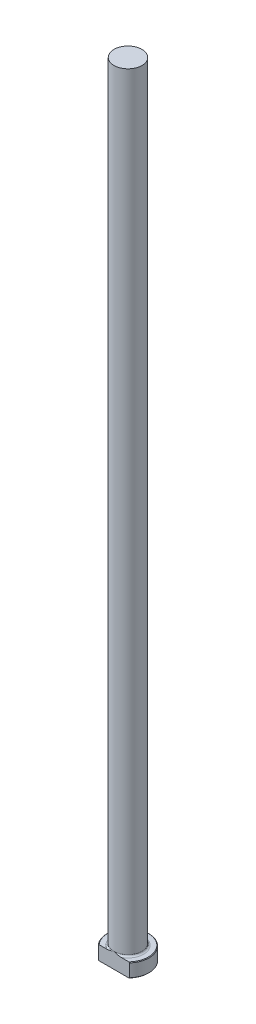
ISO-10303-21;
HEADER;
FILE_DESCRIPTION(('STEP AP214'),'2;1');
FILE_NAME('part.step','',(''),(''),'','','');
FILE_SCHEMA(('AUTOMOTIVE_DESIGN { 1 0 10303 214 1 1 1 1 }'));
ENDSEC;
DATA;
#1=APPLICATION_CONTEXT('core data for automotive mechanical design processes');
#2=APPLICATION_PROTOCOL_DEFINITION('international standard','automotive_design',2000,#1);
#3=PRODUCT_CONTEXT('',#1,'mechanical');
#4=PRODUCT('Part','Part','',(#3));
#5=PRODUCT_RELATED_PRODUCT_CATEGORY('part','',(#4));
#6=PRODUCT_DEFINITION_FORMATION('','',#4);
#7=PRODUCT_DEFINITION_CONTEXT('part definition',#1,'design');
#8=PRODUCT_DEFINITION('design','',#6,#7);
#9=PRODUCT_DEFINITION_SHAPE('','',#8);
#10=(LENGTH_UNIT() NAMED_UNIT(*) SI_UNIT(.MILLI.,.METRE.));
#11=(NAMED_UNIT(*) PLANE_ANGLE_UNIT() SI_UNIT($,.RADIAN.));
#12=(NAMED_UNIT(*) SI_UNIT($,.STERADIAN.) SOLID_ANGLE_UNIT());
#13=UNCERTAINTY_MEASURE_WITH_UNIT(LENGTH_MEASURE(1.E-05),#10,'distance_accuracy_value','');
#14=(GEOMETRIC_REPRESENTATION_CONTEXT(3) GLOBAL_UNCERTAINTY_ASSIGNED_CONTEXT((#13)) GLOBAL_UNIT_ASSIGNED_CONTEXT((#10,
#11,#12)) REPRESENTATION_CONTEXT('',''));
#15=CARTESIAN_POINT('',(0.,0.,0.));
#16=DIRECTION('',(0.,0.,1.));
#17=DIRECTION('',(1.,0.,0.));
#18=AXIS2_PLACEMENT_3D('',#15,#16,#17);
#19=CARTESIAN_POINT('',(0.,0.,0.));
#20=DIRECTION('',(0.,-1.,0.));
#21=DIRECTION('',(0.,0.,-1.));
#22=AXIS2_PLACEMENT_3D('',#19,#20,#21);
#23=PLANE('',#22);
#24=DIRECTION('',(1.,0.,0.));
#25=VECTOR('',#24,1.);
#26=CARTESIAN_POINT('',(-7.09951582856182,0.,6.34999999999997));
#27=LINE('',#26,#25);
#28=CARTESIAN_POINT('',(-6.75491976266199,0.,6.34999999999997));
#29=VERTEX_POINT('',#28);
#30=CARTESIAN_POINT('',(6.75491976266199,0.,6.34999999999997));
#31=VERTEX_POINT('',#30);
#32=EDGE_CURVE('E92',#29,#31,#27,.T.);
#33=ORIENTED_EDGE('',*,*,#32,.F.);
#34=CARTESIAN_POINT('',(0.,0.,0.));
#35=DIRECTION('',(0.,-1.,0.));
#36=DIRECTION('',(0.,0.,-1.));
#37=AXIS2_PLACEMENT_3D('',#34,#35,#36);
#38=CIRCLE('',#37,9.27100000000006);
#39=EDGE_CURVE('E105',#29,#31,#38,.T.);
#40=ORIENTED_EDGE('',*,*,#39,.T.);
#41=EDGE_LOOP('',(#33,#40));
#42=FACE_BOUND('',#41,.T.);
#43=ADVANCED_FACE('F37',(#42),#23,.T.);
#44=CARTESIAN_POINT('',(0.,259.958771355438,0.));
#45=DIRECTION('',(0.,1.,0.));
#46=DIRECTION('',(0.,0.,1.));
#47=AXIS2_PLACEMENT_3D('',#44,#45,#46);
#48=CYLINDRICAL_SURFACE('',#47,9.52499999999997);
#49=DIRECTION('',(0.,-1.,0.));
#50=VECTOR('',#49,1.);
#51=CARTESIAN_POINT('',(-7.09951582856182,355.6,6.34999999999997));
#52=LINE('',#51,#50);
#53=CARTESIAN_POINT('',(-7.09951582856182,6.09600000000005,6.34999999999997));
#54=VERTEX_POINT('',#53);
#55=CARTESIAN_POINT('',(-7.09951582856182,0.253999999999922,6.34999999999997));
#56=VERTEX_POINT('',#55);
#57=EDGE_CURVE('E95',#54,#56,#52,.T.);
#58=ORIENTED_EDGE('',*,*,#57,.F.);
#59=CARTESIAN_POINT('',(0.,6.09600000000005,0.));
#60=DIRECTION('',(0.,1.,0.));
#61=DIRECTION('',(0.,0.,1.));
#62=AXIS2_PLACEMENT_3D('',#59,#60,#61);
#63=CIRCLE('',#62,9.52499999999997);
#64=CARTESIAN_POINT('',(7.09951582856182,6.09600000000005,6.34999999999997));
#65=VERTEX_POINT('',#64);
#66=EDGE_CURVE('E109',#54,#65,#63,.F.);
#67=ORIENTED_EDGE('',*,*,#66,.T.);
#68=DIRECTION('',(0.,-1.,0.));
#69=VECTOR('',#68,1.);
#70=CARTESIAN_POINT('',(7.09951582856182,355.6,6.34999999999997));
#71=LINE('',#70,#69);
#72=CARTESIAN_POINT('',(7.09951582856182,0.253999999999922,6.34999999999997));
#73=VERTEX_POINT('',#72);
#74=EDGE_CURVE('E187',#65,#73,#71,.T.);
#75=ORIENTED_EDGE('',*,*,#74,.T.);
#76=CARTESIAN_POINT('',(0.,0.253999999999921,0.));
#77=DIRECTION('',(0.,-1.,0.));
#78=DIRECTION('',(0.,0.,-1.));
#79=AXIS2_PLACEMENT_3D('',#76,#77,#78);
#80=CIRCLE('',#79,9.52499999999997);
#81=EDGE_CURVE('E115',#73,#56,#80,.F.);
#82=ORIENTED_EDGE('',*,*,#81,.T.);
#83=EDGE_LOOP('',(#58,#67,#75,#82));
#84=FACE_BOUND('',#83,.T.);
#85=ADVANCED_FACE('F160',(#84),#48,.T.);
#86=CARTESIAN_POINT('',(-9.52499999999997,6.35,0.));
#87=DIRECTION('',(0.,1.,0.));
#88=DIRECTION('',(0.,0.,1.));
#89=AXIS2_PLACEMENT_3D('',#86,#87,#88);
#90=PLANE('',#89);
#91=DIRECTION('',(-1.,0.,0.));
#92=VECTOR('',#91,1.);
#93=CARTESIAN_POINT('',(-9.52499999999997,6.35,6.34999999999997));
#94=LINE('',#93,#92);
#95=CARTESIAN_POINT('',(6.75491976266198,6.35,6.34999999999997));
#96=VERTEX_POINT('',#95);
#97=CARTESIAN_POINT('',(3.20281813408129,6.35,6.34999999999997));
#98=VERTEX_POINT('',#97);
#99=EDGE_CURVE('E58',#96,#98,#94,.T.);
#100=ORIENTED_EDGE('',*,*,#99,.F.);
#101=CARTESIAN_POINT('',(0.,6.35,0.));
#102=DIRECTION('',(0.,1.,0.));
#103=DIRECTION('',(0.,0.,1.));
#104=AXIS2_PLACEMENT_3D('',#101,#102,#103);
#105=CIRCLE('',#104,9.27100000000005);
#106=CARTESIAN_POINT('',(-6.75491976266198,6.35,6.34999999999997));
#107=VERTEX_POINT('',#106);
#108=EDGE_CURVE('E182',#96,#107,#105,.T.);
#109=ORIENTED_EDGE('',*,*,#108,.T.);
#110=CARTESIAN_POINT('',(-3.20281813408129,6.35000000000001,6.34999999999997));
#111=VERTEX_POINT('',#110);
#112=EDGE_CURVE('E140',#111,#107,#94,.T.);
#113=ORIENTED_EDGE('',*,*,#112,.F.);
#114=CARTESIAN_POINT('',(0.,6.35,0.));
#115=DIRECTION('',(0.,1.,0.));
#116=DIRECTION('',(0.,0.,1.));
#117=AXIS2_PLACEMENT_3D('',#114,#115,#116);
#118=CIRCLE('',#117,7.11199999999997);
#119=EDGE_CURVE('E112',#111,#98,#118,.F.);
#120=ORIENTED_EDGE('',*,*,#119,.T.);
#121=EDGE_LOOP('',(#100,#109,#113,#120));
#122=FACE_BOUND('',#121,.T.);
#123=ADVANCED_FACE('F164',(#122),#90,.T.);
#124=CARTESIAN_POINT('',(0.,259.958771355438,0.));
#125=DIRECTION('',(0.,1.,0.));
#126=DIRECTION('',(0.,0.,1.));
#127=AXIS2_PLACEMENT_3D('',#124,#125,#126);
#128=CYLINDRICAL_SURFACE('',#127,6.34999999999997);
#129=CARTESIAN_POINT('',(0.,7.11200000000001,0.));
#130=DIRECTION('',(0.,1.,0.));
#131=DIRECTION('',(0.,0.,1.));
#132=AXIS2_PLACEMENT_3D('',#129,#130,#131);
#133=CIRCLE('',#132,6.34999999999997);
#134=CARTESIAN_POINT('',(0.,7.11200000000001,6.34999999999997));
#135=VERTEX_POINT('',#134);
#136=EDGE_CURVE('E108',#135,#135,#133,.T.);
#137=ORIENTED_EDGE('',*,*,#136,.T.);
#138=EDGE_LOOP('',(#137));
#139=FACE_BOUND('',#138,.T.);
#140=CARTESIAN_POINT('',(0.,355.6,0.));
#141=DIRECTION('',(0.,1.,0.));
#142=DIRECTION('',(0.,0.,1.));
#143=AXIS2_PLACEMENT_3D('',#140,#141,#142);
#144=CIRCLE('',#143,6.34999999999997);
#145=CARTESIAN_POINT('',(0.,355.6,6.34999999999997));
#146=VERTEX_POINT('',#145);
#147=EDGE_CURVE('E100',#146,#146,#144,.T.);
#148=ORIENTED_EDGE('',*,*,#147,.F.);
#149=EDGE_LOOP('',(#148));
#150=FACE_BOUND('',#149,.T.);
#151=ADVANCED_FACE('F169',(#139,#150),#128,.T.);
#152=CARTESIAN_POINT('',(-6.34999999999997,355.6,0.));
#153=DIRECTION('',(0.,1.,0.));
#154=DIRECTION('',(0.,0.,1.));
#155=AXIS2_PLACEMENT_3D('',#152,#153,#154);
#156=PLANE('',#155);
#157=ORIENTED_EDGE('',*,*,#147,.T.);
#158=EDGE_LOOP('',(#157));
#159=FACE_BOUND('',#158,.T.);
#160=ADVANCED_FACE('F127',(#159),#156,.T.);
#161=CARTESIAN_POINT('',(0.,6.35000000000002,0.));
#162=DIRECTION('',(0.,-1.,0.));
#163=DIRECTION('',(0.,0.,-1.));
#164=AXIS2_PLACEMENT_3D('',#161,#162,#163);
#165=CONICAL_SURFACE('',#164,9.27100000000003,0.785398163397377);
#166=CARTESIAN_POINT('',(7.10021582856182,6.09547823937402,6.34999999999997));
#167=CARTESIAN_POINT('',(6.91781888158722,6.23139855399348,6.34999999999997));
#168=CARTESIAN_POINT('',(6.73432708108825,6.36587704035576,6.34999999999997));
#169=CARTESIAN_POINT('',(6.36470171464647,6.63127285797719,6.34999999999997));
#170=CARTESIAN_POINT('',(6.17856733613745,6.76218905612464,6.34999999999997));
#171=CARTESIAN_POINT('',(5.8014623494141,7.02097048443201,6.34999999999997));
#172=CARTESIAN_POINT('',(5.61046211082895,7.14879270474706,6.34999999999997));
#173=CARTESIAN_POINT('',(5.22495134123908,7.39901115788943,6.34999999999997));
#174=CARTESIAN_POINT('',(5.03044111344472,7.52140785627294,6.34999999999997));
#175=CARTESIAN_POINT('',(4.6268505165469,7.76586837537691,6.34999999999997));
#176=CARTESIAN_POINT('',(4.41754671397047,7.8875654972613,6.34999999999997));
#177=CARTESIAN_POINT('',(3.99368696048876,8.1216129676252,6.34999999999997));
#178=CARTESIAN_POINT('',(3.7791300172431,8.23396153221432,6.34999999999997));
#179=CARTESIAN_POINT('',(3.34498236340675,8.44634293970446,6.34999999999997));
#180=CARTESIAN_POINT('',(3.12541442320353,8.54642189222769,6.34999999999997));
#181=CARTESIAN_POINT('',(2.6800932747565,8.73155577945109,6.34999999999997));
#182=CARTESIAN_POINT('',(2.45434362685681,8.81661916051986,6.34999999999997));
#183=CARTESIAN_POINT('',(2.01016927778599,8.96351969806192,6.34999999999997));
#184=CARTESIAN_POINT('',(1.79210653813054,9.02643671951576,6.34999999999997));
#185=CARTESIAN_POINT('',(1.35110157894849,9.13237723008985,6.34999999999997));
#186=CARTESIAN_POINT('',(1.12815920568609,9.17540009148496,6.34999999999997));
#187=CARTESIAN_POINT('',(0.68318447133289,9.23807907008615,6.34999999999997));
#188=CARTESIAN_POINT('',(0.461212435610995,9.258155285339,6.34999999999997));
#189=CARTESIAN_POINT('',(0.0163838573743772,9.27486764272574,6.34999999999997));
#190=CARTESIAN_POINT('',(-0.206472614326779,9.27150562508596,6.34999999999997));
#191=CARTESIAN_POINT('',(-0.65038307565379,9.24162161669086,6.34999999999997));
#192=CARTESIAN_POINT('',(-0.871438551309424,9.21512120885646,6.34999999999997));
#193=CARTESIAN_POINT('',(-1.30993093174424,9.14090297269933,6.34999999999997));
#194=CARTESIAN_POINT('',(-1.52736709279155,9.09318083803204,6.34999999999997));
#195=CARTESIAN_POINT('',(-1.96127346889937,8.97837511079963,6.34999999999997));
#196=CARTESIAN_POINT('',(-2.17765211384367,8.9109510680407,6.34999999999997));
#197=CARTESIAN_POINT('',(-2.60480250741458,8.76042358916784,6.34999999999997));
#198=CARTESIAN_POINT('',(-2.81557435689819,8.67732043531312,6.34999999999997));
#199=CARTESIAN_POINT('',(-3.2114412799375,8.5071340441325,6.34999999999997));
#200=CARTESIAN_POINT('',(-3.39704436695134,8.42121810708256,6.34999999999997));
#201=CARTESIAN_POINT('',(-3.76411886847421,8.2409239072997,6.34999999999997));
#202=CARTESIAN_POINT('',(-3.94558937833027,8.14654381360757,6.34999999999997));
#203=CARTESIAN_POINT('',(-4.30501809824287,7.95073685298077,6.34999999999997));
#204=CARTESIAN_POINT('',(-4.48297064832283,7.84929965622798,6.34999999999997));
#205=CARTESIAN_POINT('',(-4.83551679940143,7.64074147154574,6.34999999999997));
#206=CARTESIAN_POINT('',(-5.01011015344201,7.53362006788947,6.34999999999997));
#207=CARTESIAN_POINT('',(-5.34789306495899,7.3200246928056,6.34999999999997));
#208=CARTESIAN_POINT('',(-5.51122388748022,7.21377328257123,6.34999999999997));
#209=CARTESIAN_POINT('',(-5.83551765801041,6.997708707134,6.34999999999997));
#210=CARTESIAN_POINT('',(-5.99648050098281,6.88789538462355,6.34999999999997));
#211=CARTESIAN_POINT('',(-6.31563015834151,6.66574491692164,6.34999999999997));
#212=CARTESIAN_POINT('',(-6.47382589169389,6.55342055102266,6.34999999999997));
#213=CARTESIAN_POINT('',(-6.78835294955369,6.32624333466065,6.34999999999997));
#214=CARTESIAN_POINT('',(-6.94468457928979,6.21139090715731,6.34999999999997));
#215=CARTESIAN_POINT('',(-7.10021582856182,6.09547823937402,6.34999999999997));
#216=B_SPLINE_CURVE_WITH_KNOTS('',3,(#166,#167,#168,#169,#170,#171,#172,#173,#174,#175,#176,
#177,#178,#179,#180,#181,#182,#183,#184,#185,#186,#187,#188,#189,#190,#191,#192,#193,#194,#195,
#196,#197,#198,#199,#200,#201,#202,#203,#204,#205,#206,#207,#208,#209,#210,#211,#212,#213,#214,
#215),.UNSPECIFIED.,.F.,.F.,(4,2,2,2,2,2,2,2,2,2,2,2,2,2,2,2,2,2,2,2,2,2,2,2,4),(0.,
0.682429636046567,1.36507386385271,2.05447314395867,2.74381315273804,3.46995885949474,
4.19624281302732,4.91970777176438,5.6427644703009,6.32285167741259,7.00296034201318,
7.67040771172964,8.33780267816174,9.0045757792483,9.67148424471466,10.3506773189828,
11.0298581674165,11.6431816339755,12.2566380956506,12.8710122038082,13.4854313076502,
14.0699261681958,14.6544468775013,15.2364716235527,15.8183997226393),.UNSPECIFIED.);
#217=EDGE_CURVE('E63',#65,#96,#216,.T.);
#218=ORIENTED_EDGE('',*,*,#217,.F.);
#219=ORIENTED_EDGE('',*,*,#66,.F.);
#220=EDGE_CURVE('E133',#107,#54,#216,.T.);
#221=ORIENTED_EDGE('',*,*,#220,.F.);
#222=ORIENTED_EDGE('',*,*,#108,.F.);
#223=EDGE_LOOP('',(#218,#219,#221,#222));
#224=FACE_BOUND('',#223,.T.);
#225=ADVANCED_FACE('F147',(#224),#165,.T.);
#226=CARTESIAN_POINT('',(0.,0.253999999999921,0.));
#227=DIRECTION('',(0.,1.,0.));
#228=DIRECTION('',(0.,0.,1.));
#229=AXIS2_PLACEMENT_3D('',#226,#227,#228);
#230=CONICAL_SURFACE('',#229,9.52499999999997,0.785398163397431);
#231=CARTESIAN_POINT('',(-7.10021582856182,0.254521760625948,6.34999999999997));
#232=CARTESIAN_POINT('',(-6.91781888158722,0.118601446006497,6.34999999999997));
#233=CARTESIAN_POINT('',(-6.73432708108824,-0.0158770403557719,6.34999999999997));
#234=CARTESIAN_POINT('',(-6.36470171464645,-0.28127285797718,6.34999999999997));
#235=CARTESIAN_POINT('',(-6.17856733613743,-0.412189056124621,6.34999999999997));
#236=CARTESIAN_POINT('',(-5.80146234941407,-0.670970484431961,6.34999999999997));
#237=CARTESIAN_POINT('',(-5.61046211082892,-0.798792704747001,6.34999999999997));
#238=CARTESIAN_POINT('',(-5.22495134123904,-1.04901115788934,6.34999999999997));
#239=CARTESIAN_POINT('',(-5.03044111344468,-1.17140785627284,6.34999999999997));
#240=CARTESIAN_POINT('',(-4.62685051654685,-1.41586837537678,6.34999999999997));
#241=CARTESIAN_POINT('',(-4.41754671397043,-1.53756549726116,6.34999999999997));
#242=CARTESIAN_POINT('',(-3.99368696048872,-1.77161296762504,6.34999999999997));
#243=CARTESIAN_POINT('',(-3.77913001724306,-1.88396153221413,6.34999999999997));
#244=CARTESIAN_POINT('',(-3.34498236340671,-2.09634293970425,6.34999999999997));
#245=CARTESIAN_POINT('',(-3.1254144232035,-2.19642189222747,6.34999999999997));
#246=CARTESIAN_POINT('',(-2.68009327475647,-2.38155577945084,6.34999999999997));
#247=CARTESIAN_POINT('',(-2.45434362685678,-2.46661916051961,6.34999999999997));
#248=CARTESIAN_POINT('',(-2.01016927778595,-2.61351969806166,6.34999999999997));
#249=CARTESIAN_POINT('',(-1.79210653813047,-2.67643671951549,6.34999999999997));
#250=CARTESIAN_POINT('',(-1.35110157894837,-2.78237723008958,6.34999999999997));
#251=CARTESIAN_POINT('',(-1.12815920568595,-2.82540009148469,6.34999999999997));
#252=CARTESIAN_POINT('',(-0.683184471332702,-2.88807907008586,6.34999999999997));
#253=CARTESIAN_POINT('',(-0.461212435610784,-2.9081552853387,6.34999999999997));
#254=CARTESIAN_POINT('',(-0.0163838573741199,-2.92486764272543,6.34999999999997));
#255=CARTESIAN_POINT('',(0.206472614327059,-2.92150562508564,6.34999999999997));
#256=CARTESIAN_POINT('',(0.650383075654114,-2.89162161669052,6.34999999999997));
#257=CARTESIAN_POINT('',(0.871438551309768,-2.86512120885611,6.34999999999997));
#258=CARTESIAN_POINT('',(1.30993093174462,-2.79090297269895,6.34999999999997));
#259=CARTESIAN_POINT('',(1.52736709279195,-2.74318083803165,6.34999999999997));
#260=CARTESIAN_POINT('',(1.96127346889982,-2.62837511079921,6.34999999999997));
#261=CARTESIAN_POINT('',(2.17765211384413,-2.56095106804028,6.34999999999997));
#262=CARTESIAN_POINT('',(2.60480250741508,-2.41042358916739,6.34999999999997));
#263=CARTESIAN_POINT('',(2.8155743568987,-2.32732043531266,6.34999999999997));
#264=CARTESIAN_POINT('',(3.211441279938,-2.15713404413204,6.34999999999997));
#265=CARTESIAN_POINT('',(3.39704436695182,-2.07121810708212,6.34999999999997));
#266=CARTESIAN_POINT('',(3.76411886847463,-1.89092390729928,6.34999999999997));
#267=CARTESIAN_POINT('',(3.94558937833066,-1.79654381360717,6.34999999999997));
#268=CARTESIAN_POINT('',(4.30501809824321,-1.60073685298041,6.34999999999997));
#269=CARTESIAN_POINT('',(4.48297064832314,-1.49929965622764,6.34999999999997));
#270=CARTESIAN_POINT('',(4.83551679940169,-1.29074147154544,6.34999999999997));
#271=CARTESIAN_POINT('',(5.01011015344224,-1.1836200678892,6.34999999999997));
#272=CARTESIAN_POINT('',(5.34789306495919,-0.97002469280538,6.34999999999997));
#273=CARTESIAN_POINT('',(5.5112238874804,-0.863773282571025,6.34999999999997));
#274=CARTESIAN_POINT('',(5.83551765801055,-0.647708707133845,6.34999999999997));
#275=CARTESIAN_POINT('',(5.99648050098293,-0.53789538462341,6.34999999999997));
#276=CARTESIAN_POINT('',(6.3156301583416,-0.315744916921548,6.34999999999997));
#277=CARTESIAN_POINT('',(6.47382589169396,-0.203420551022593,6.34999999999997));
#278=CARTESIAN_POINT('',(6.78835294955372,0.0237566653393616,6.34999999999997));
#279=CARTESIAN_POINT('',(6.94468457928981,0.138609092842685,6.34999999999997));
#280=CARTESIAN_POINT('',(7.10021582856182,0.254521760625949,6.34999999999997));
#281=B_SPLINE_CURVE_WITH_KNOTS('',3,(#231,#232,#233,#234,#235,#236,#237,#238,#239,#240,#241,
#242,#243,#244,#245,#246,#247,#248,#249,#250,#251,#252,#253,#254,#255,#256,#257,#258,#259,#260,
#261,#262,#263,#264,#265,#266,#267,#268,#269,#270,#271,#272,#273,#274,#275,#276,#277,#278,#279,
#280),.UNSPECIFIED.,.F.,.F.,(4,2,2,2,2,2,2,2,2,2,2,2,2,2,2,2,2,2,2,2,2,2,2,2,4),(0.,
0.682429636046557,1.36507386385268,2.05447314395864,2.74381315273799,3.46995885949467,
4.19624281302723,4.91970777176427,5.64276447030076,6.32285167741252,7.00296034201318,
7.67040771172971,8.33780267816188,9.0045757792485,9.67148424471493,10.3506773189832,
11.0298581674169,11.6431816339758,12.2566380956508,12.8710122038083,13.4854313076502,
14.0699261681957,14.6544468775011,15.2364716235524,15.818399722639),.UNSPECIFIED.);
#282=EDGE_CURVE('E89',#56,#29,#281,.T.);
#283=ORIENTED_EDGE('',*,*,#282,.F.);
#284=ORIENTED_EDGE('',*,*,#81,.F.);
#285=EDGE_CURVE('E101',#31,#73,#281,.T.);
#286=ORIENTED_EDGE('',*,*,#285,.F.);
#287=ORIENTED_EDGE('',*,*,#39,.F.);
#288=EDGE_LOOP('',(#283,#284,#286,#287));
#289=FACE_BOUND('',#288,.T.);
#290=ADVANCED_FACE('F107',(#289),#230,.T.);
#291=CARTESIAN_POINT('',(0.,7.11200000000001,0.));
#292=DIRECTION('',(0.,1.,0.));
#293=DIRECTION('',(0.,0.,1.));
#294=AXIS2_PLACEMENT_3D('',#291,#292,#293);
#295=TOROIDAL_SURFACE('',#294,7.11199999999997,0.762);
#296=ORIENTED_EDGE('',*,*,#119,.F.);
#297=CARTESIAN_POINT('',(0.,7.11200000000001,6.34999999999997));
#298=CARTESIAN_POINT('',(1.98730332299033E-11,7.11200099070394,6.34999999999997));
#299=CARTESIAN_POINT('',(-2.54281773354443E-07,7.11200198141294,6.34999999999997));
#300=CARTESIAN_POINT('',(-1.0280306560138E-06,7.11200387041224,6.34999999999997));
#301=CARTESIAN_POINT('',(-1.55832945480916E-06,7.11200476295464,6.34999999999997));
#302=CARTESIAN_POINT('',(-2.82630076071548E-06,7.11200655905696,6.34999999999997));
#303=CARTESIAN_POINT('',(-3.5815916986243E-06,7.11200745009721,6.34999999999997));
#304=CARTESIAN_POINT('',(-5.19075123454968E-06,7.11200910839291,6.34999999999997));
#305=CARTESIAN_POINT('',(-6.0431182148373E-06,7.11200987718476,6.34999999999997));
#306=CARTESIAN_POINT('',(-9.16920499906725E-06,7.11201253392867,6.34999999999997));
#307=CARTESIAN_POINT('',(-1.15677962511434E-05,7.11201427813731,6.34999999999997));
#308=CARTESIAN_POINT('',(-1.64593528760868E-05,7.11201731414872,6.34999999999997));
#309=CARTESIAN_POINT('',(-1.89415872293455E-05,7.11201862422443,6.34999999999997));
#310=CARTESIAN_POINT('',(-2.88859728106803E-05,7.11202372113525,6.34999999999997));
#311=CARTESIAN_POINT('',(-3.64752267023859E-05,7.11202727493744,6.34999999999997));
#312=CARTESIAN_POINT('',(-5.12411228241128E-05,7.11203291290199,6.34999999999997));
#313=CARTESIAN_POINT('',(-5.83739462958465E-05,7.11203511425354,6.34999999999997));
#314=CARTESIAN_POINT('',(-8.94436376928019E-05,7.11204475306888,6.34999999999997));
#315=CARTESIAN_POINT('',(-0.000113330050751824,7.11205229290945,6.34999999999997));
#316=CARTESIAN_POINT('',(-0.000157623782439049,7.11206410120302,6.34999999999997));
#317=CARTESIAN_POINT('',(-0.000177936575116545,7.11206870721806,6.34999999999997));
#318=CARTESIAN_POINT('',(-0.000328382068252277,7.11210592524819,6.34999999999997));
#319=CARTESIAN_POINT('',(-0.00045394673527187,7.1121544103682,6.34999999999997));
#320=CARTESIAN_POINT('',(-0.000946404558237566,7.11233771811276,6.34999999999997));
#321=CARTESIAN_POINT('',(-0.00131646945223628,7.11246069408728,6.34999999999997));
#322=CARTESIAN_POINT('',(-0.00276809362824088,7.11295007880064,6.34999999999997));
#323=CARTESIAN_POINT('',(-0.00384642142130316,7.11332889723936,6.34999999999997));
#324=CARTESIAN_POINT('',(-0.0083006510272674,7.11488653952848,6.34999999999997));
#325=CARTESIAN_POINT('',(-0.0116800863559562,7.1160514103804,6.34999999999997));
#326=CARTESIAN_POINT('',(-0.0812880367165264,7.14005423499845,6.34999999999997));
#327=CARTESIAN_POINT('',(-0.147476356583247,7.1630529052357,6.34999999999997));
#328=CARTESIAN_POINT('',(-0.27735683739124,7.20792044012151,6.34999999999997));
#329=CARTESIAN_POINT('',(-0.341046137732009,7.22979850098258,6.34999999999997));
#330=CARTESIAN_POINT('',(-0.476297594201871,7.27596846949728,6.34999999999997));
#331=CARTESIAN_POINT('',(-0.547870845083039,7.30022868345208,6.34999999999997));
#332=CARTESIAN_POINT('',(-0.691958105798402,7.34848126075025,6.34999999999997));
#333=CARTESIAN_POINT('',(-0.764473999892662,7.37246799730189,6.34999999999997));
#334=CARTESIAN_POINT('',(-0.889840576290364,7.4132466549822,6.34999999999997));
#335=CARTESIAN_POINT('',(-0.942635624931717,7.43020921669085,6.34999999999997));
#336=CARTESIAN_POINT('',(-1.04823844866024,7.46363183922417,6.34999999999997));
#337=CARTESIAN_POINT('',(-1.10104585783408,7.48009305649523,6.34999999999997));
#338=CARTESIAN_POINT('',(-1.25725277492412,7.5279153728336,6.34999999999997));
#339=CARTESIAN_POINT('',(-1.360886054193,7.55851914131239,6.34999999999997));
#340=CARTESIAN_POINT('',(-1.59088732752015,7.62320257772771,6.34999999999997));
#341=CARTESIAN_POINT('',(-1.71743494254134,7.65665155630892,6.34999999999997));
#342=CARTESIAN_POINT('',(-1.97280417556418,7.71848782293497,6.34999999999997));
#343=CARTESIAN_POINT('',(-2.10163577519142,7.74683457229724,6.34999999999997));
#344=CARTESIAN_POINT('',(-2.3700410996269,7.79828507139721,6.34999999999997));
#345=CARTESIAN_POINT('',(-2.50971812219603,7.82086167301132,6.34999999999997));
#346=CARTESIAN_POINT('',(-2.79011040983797,7.85525616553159,6.34999999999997));
#347=CARTESIAN_POINT('',(-2.93082167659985,7.86710398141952,6.34999999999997));
#348=CARTESIAN_POINT('',(-3.14072761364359,7.87407656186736,6.34999999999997));
#349=CARTESIAN_POINT('',(-3.20974558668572,7.87465175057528,6.34999999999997));
#350=CARTESIAN_POINT('',(-3.34768897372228,7.87178528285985,6.34999999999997));
#351=CARTESIAN_POINT('',(-3.41661441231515,7.86834509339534,6.34999999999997));
#352=CARTESIAN_POINT('',(-3.55295435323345,7.856840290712,6.34999999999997));
#353=CARTESIAN_POINT('',(-3.62037508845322,7.8488524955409,6.34999999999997));
#354=CARTESIAN_POINT('',(-3.75432209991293,7.82745899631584,6.34999999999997));
#355=CARTESIAN_POINT('',(-3.82084914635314,7.81405831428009,6.34999999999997));
#356=CARTESIAN_POINT('',(-3.94402160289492,7.78281890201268,6.34999999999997));
#357=CARTESIAN_POINT('',(-4.00085861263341,7.76574904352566,6.34999999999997));
#358=CARTESIAN_POINT('',(-4.11269317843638,7.72554243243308,6.34999999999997));
#359=CARTESIAN_POINT('',(-4.16768138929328,7.70237893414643,6.34999999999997));
#360=CARTESIAN_POINT('',(-4.274754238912,7.64845340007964,6.34999999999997));
#361=CARTESIAN_POINT('',(-4.32679331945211,7.61759890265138,6.34999999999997));
#362=CARTESIAN_POINT('',(-4.42436914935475,7.54697047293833,6.34999999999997));
#363=CARTESIAN_POINT('',(-4.46994081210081,7.50724766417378,6.34999999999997));
#364=CARTESIAN_POINT('',(-4.53046555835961,7.43959446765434,6.34999999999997));
#365=CARTESIAN_POINT('',(-4.54952297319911,7.41533971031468,6.34999999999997));
#366=CARTESIAN_POINT('',(-4.58379853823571,7.36421578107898,6.34999999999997));
#367=CARTESIAN_POINT('',(-4.59901798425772,7.33734749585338,6.34999999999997));
#368=CARTESIAN_POINT('',(-4.6247071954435,7.28103780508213,6.34999999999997));
#369=CARTESIAN_POINT('',(-4.63512457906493,7.25157201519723,6.34999999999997));
#370=CARTESIAN_POINT('',(-4.64995843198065,7.1911663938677,6.34999999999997));
#371=CARTESIAN_POINT('',(-4.6543827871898,7.16022855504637,6.34999999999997));
#372=CARTESIAN_POINT('',(-4.65660008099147,7.1022078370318,6.34999999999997));
#373=CARTESIAN_POINT('',(-4.65518871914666,7.07515315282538,6.34999999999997));
#374=CARTESIAN_POINT('',(-4.64761946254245,7.02171954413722,6.34999999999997));
#375=CARTESIAN_POINT('',(-4.64146071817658,6.99534074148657,6.34999999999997));
#376=CARTESIAN_POINT('',(-4.62523755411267,6.94504159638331,6.34999999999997));
#377=CARTESIAN_POINT('',(-4.61534502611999,6.92106470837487,6.34999999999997));
#378=CARTESIAN_POINT('',(-4.59226170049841,6.8747751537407,6.34999999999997));
#379=CARTESIAN_POINT('',(-4.5790700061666,6.8524629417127,6.34999999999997));
#380=CARTESIAN_POINT('',(-4.5418218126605,6.79764783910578,6.34999999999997));
#381=CARTESIAN_POINT('',(-4.51582520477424,6.76646268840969,6.34999999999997));
#382=CARTESIAN_POINT('',(-4.45923244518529,6.70856515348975,6.34999999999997));
#383=CARTESIAN_POINT('',(-4.42862238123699,6.68186683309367,6.34999999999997));
#384=CARTESIAN_POINT('',(-4.34541293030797,6.61817721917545,6.34999999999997));
#385=CARTESIAN_POINT('',(-4.29043455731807,6.58431535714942,6.34999999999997));
#386=CARTESIAN_POINT('',(-4.17622180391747,6.52522207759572,6.34999999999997));
#387=CARTESIAN_POINT('',(-4.11698677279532,6.49999198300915,6.34999999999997));
#388=CARTESIAN_POINT('',(-4.00208843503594,6.4587014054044,6.34999999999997));
#389=CARTESIAN_POINT('',(-3.9466577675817,6.4419775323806,6.34999999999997));
#390=CARTESIAN_POINT('',(-3.83455009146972,6.41329756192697,6.34999999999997));
#391=CARTESIAN_POINT('',(-3.77787201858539,6.40134571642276,6.34999999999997));
#392=CARTESIAN_POINT('',(-3.66308050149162,6.38138585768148,6.34999999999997));
#393=CARTESIAN_POINT('',(-3.60495797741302,6.37343127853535,6.34999999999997));
#394=CARTESIAN_POINT('',(-3.4883799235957,6.36111790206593,6.34999999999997));
#395=CARTESIAN_POINT('',(-3.42992460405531,6.35675704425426,6.34999999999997));
#396=CARTESIAN_POINT('',(-3.29509240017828,6.35029195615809,6.34999999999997));
#397=CARTESIAN_POINT('',(-3.2186642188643,6.34927526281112,6.34999999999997));
#398=CARTESIAN_POINT('',(-3.06586811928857,6.35168618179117,6.34999999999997));
#399=CARTESIAN_POINT('',(-2.98950023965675,6.35511565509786,6.34999999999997));
#400=CARTESIAN_POINT('',(-2.76031250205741,6.3710761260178,6.34999999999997));
#401=CARTESIAN_POINT('',(-2.607884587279,6.38929295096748,6.34999999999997));
#402=CARTESIAN_POINT('',(-2.31432643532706,6.43528521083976,6.34999999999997));
#403=CARTESIAN_POINT('',(-2.17308394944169,6.46239447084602,6.34999999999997));
#404=CARTESIAN_POINT('',(-1.89333619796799,6.52366707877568,6.34999999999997));
#405=CARTESIAN_POINT('',(-1.75481809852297,6.55777263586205,6.34999999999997));
#406=CARTESIAN_POINT('',(-1.50173407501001,6.62528392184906,6.34999999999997));
#407=CARTESIAN_POINT('',(-1.3869516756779,6.65789391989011,6.34999999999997));
#408=CARTESIAN_POINT('',(-1.21403608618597,6.70931360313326,6.34999999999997));
#409=CARTESIAN_POINT('',(-1.15559330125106,6.72709180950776,6.34999999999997));
#410=CARTESIAN_POINT('',(-1.03875270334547,6.76331573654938,6.34999999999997));
#411=CARTESIAN_POINT('',(-0.980355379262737,6.78176303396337,6.34999999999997));
#412=CARTESIAN_POINT('',(-0.84182633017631,6.82619675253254,6.34999999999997));
#413=CARTESIAN_POINT('',(-0.761768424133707,6.85241274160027,6.34999999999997));
#414=CARTESIAN_POINT('',(-0.602738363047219,6.90528054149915,6.34999999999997));
#415=CARTESIAN_POINT('',(-0.523763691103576,6.93192479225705,6.34999999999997));
#416=CARTESIAN_POINT('',(-0.374563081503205,6.98270346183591,6.34999999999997));
#417=CARTESIAN_POINT('',(-0.304322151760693,7.00679476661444,6.34999999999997));
#418=CARTESIAN_POINT('',(-0.161086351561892,7.05623678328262,6.34999999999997));
#419=CARTESIAN_POINT('',(-0.0880951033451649,7.0815989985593,6.34999999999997));
#420=CARTESIAN_POINT('',(-0.0116796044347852,7.10794873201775,6.34999999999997));
#421=CARTESIAN_POINT('',(-0.00829969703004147,7.10911378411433,6.34999999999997));
#422=CARTESIAN_POINT('',(-0.0038453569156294,7.1106714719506,6.34999999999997));
#423=CARTESIAN_POINT('',(-0.00276739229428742,7.11105016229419,6.34999999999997));
#424=CARTESIAN_POINT('',(-0.0013162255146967,7.11153939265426,6.34999999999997));
#425=CARTESIAN_POINT('',(-0.000946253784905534,7.11166233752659,6.34999999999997));
#426=CARTESIAN_POINT('',(-0.000453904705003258,7.11184560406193,6.34999999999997));
#427=CARTESIAN_POINT('',(-0.000328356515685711,7.11189408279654,6.34999999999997));
#428=CARTESIAN_POINT('',(-0.000177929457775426,7.11193129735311,6.34999999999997));
#429=CARTESIAN_POINT('',(-0.000157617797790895,7.11193590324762,6.34999999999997));
#430=CARTESIAN_POINT('',(-0.000113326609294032,7.11194771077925,6.34999999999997));
#431=CARTESIAN_POINT('',(-8.9441576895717E-05,7.11195524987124,6.34999999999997));
#432=CARTESIAN_POINT('',(-5.83734289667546E-05,7.1119648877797,6.34999999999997));
#433=CARTESIAN_POINT('',(-5.12407709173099E-05,7.11196708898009,6.34999999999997));
#434=CARTESIAN_POINT('',(-3.64751950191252E-05,7.11197272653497,6.34999999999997));
#435=CARTESIAN_POINT('',(-2.88860890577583E-05,7.11197628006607,6.34999999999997));
#436=CARTESIAN_POINT('',(-1.89418472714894E-05,7.11198137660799,6.34999999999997));
#437=CARTESIAN_POINT('',(-1.64596255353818E-05,7.11198268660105,6.34999999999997));
#438=CARTESIAN_POINT('',(-1.15680783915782E-05,7.11198572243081,6.34999999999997));
#439=CARTESIAN_POINT('',(-9.16948288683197E-06,7.11198746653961,6.34999999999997));
#440=CARTESIAN_POINT('',(-6.04337167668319E-06,7.11199012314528,6.34999999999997));
#441=CARTESIAN_POINT('',(-5.19099381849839E-06,7.11199089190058,6.34999999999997));
#442=CARTESIAN_POINT('',(-3.58180595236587E-06,7.11199255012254,6.34999999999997));
#443=CARTESIAN_POINT('',(-2.82649744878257E-06,7.11199344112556,6.34999999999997));
#444=CARTESIAN_POINT('',(-1.55848394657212E-06,7.1119952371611,6.34999999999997));
#445=CARTESIAN_POINT('',(-1.02816162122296E-06,7.11199612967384,6.34999999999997));
#446=CARTESIAN_POINT('',(-2.54355049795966E-07,7.11199801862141,6.34999999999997));
#447=CARTESIAN_POINT('',(-1.98727903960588E-11,7.11199900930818,6.34999999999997));
#448=CARTESIAN_POINT('',(0.,7.11200000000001,6.34999999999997));
#449=B_SPLINE_CURVE_WITH_KNOTS('',3,(#297,#298,#299,#300,#301,#302,#303,#304,#305,#306,#307,
#308,#309,#310,#311,#312,#313,#314,#315,#316,#317,#318,#319,#320,#321,#322,#323,#324,#325,#326,
#327,#328,#329,#330,#331,#332,#333,#334,#335,#336,#337,#338,#339,#340,#341,#342,#343,#344,#345,
#346,#347,#348,#349,#350,#351,#352,#353,#354,#355,#356,#357,#358,#359,#360,#361,#362,#363,#364,
#365,#366,#367,#368,#369,#370,#371,#372,#373,#374,#375,#376,#377,#378,#379,#380,#381,#382,#383,
#384,#385,#386,#387,#388,#389,#390,#391,#392,#393,#394,#395,#396,#397,#398,#399,#400,#401,#402,
#403,#404,#405,#406,#407,#408,#409,#410,#411,#412,#413,#414,#415,#416,#417,#418,#419,#420,#421,
#422,#423,#424,#425,#426,#427,#428,#429,#430,#431,#432,#433,#434,#435,#436,#437,#438,#439,#440,
#441,#442,#443,#444,#445,#446,#447,#448),.UNSPECIFIED.,.T.,.F.,(4,2,2,2,2,2,2,2,2,2,2,2,2,2,2,2,
2,2,2,2,2,2,2,2,2,2,2,2,2,2,2,2,2,2,2,2,2,2,2,2,2,2,2,2,2,2,2,2,2,2,2,2,2,2,2,2,2,2,2,2,2,2,2,2,
2,2,2,2,2,2,2,2,2,2,2,4),(0.,2.97433544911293E-06,6.07559574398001E-06,9.56379482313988E-06,
1.30039324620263E-05,2.18605341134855E-05,3.02738862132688E-05,5.53487649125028E-05,
7.77184254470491E-05,0.000152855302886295,0.000215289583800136,0.00061784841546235,
0.00178877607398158,0.0052162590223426,0.0159413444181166,0.226133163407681,0.428164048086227,
0.654880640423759,0.884018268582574,1.0503756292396,1.21631462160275,1.54046085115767,
1.93305663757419,2.32864586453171,2.75283206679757,3.17583144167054,3.38280101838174,
3.58969500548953,3.7931936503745,3.99650392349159,4.1742770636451,4.35284387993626,
4.53367075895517,4.71348096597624,4.80574017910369,4.89796820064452,4.99117974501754,
5.08426851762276,5.16511313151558,5.24597221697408,5.32349031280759,5.40102950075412,
5.52213385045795,5.64361099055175,5.83623332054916,6.02888515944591,6.20233104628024,
6.37593113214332,6.55179391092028,6.72755578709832,6.95669586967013,7.18593189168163,
7.64582563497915,8.0770692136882,8.50488455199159,8.86281618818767,9.04607408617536,
9.22979617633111,9.48251462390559,9.73255559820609,9.95533260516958,10.1871278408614,
10.1978544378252,10.2012807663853,10.2024513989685,10.202853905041,10.2029163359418,
10.2029914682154,10.2030138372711,10.203038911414,10.2030473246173,10.203056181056,
10.2030596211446,10.2030631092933,10.2030662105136,10.2030691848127),.UNSPECIFIED.);
#450=EDGE_CURVE('E11',#111,#135,#449,.T.);
#451=ORIENTED_EDGE('',*,*,#450,.T.);
#452=ORIENTED_EDGE('',*,*,#136,.F.);
#453=CARTESIAN_POINT('',(0.,7.11200000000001,6.34999999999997));
#454=CARTESIAN_POINT('',(-1.98732861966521E-11,7.11199900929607,6.34999999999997));
#455=CARTESIAN_POINT('',(2.54281773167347E-07,7.11199801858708,6.34999999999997));
#456=CARTESIAN_POINT('',(1.02803065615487E-06,7.11199612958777,6.34999999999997));
#457=CARTESIAN_POINT('',(1.55832945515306E-06,7.11199523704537,6.34999999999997));
#458=CARTESIAN_POINT('',(2.82630076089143E-06,7.11199344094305,6.34999999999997));
#459=CARTESIAN_POINT('',(3.58159169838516E-06,7.1119925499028,6.34999999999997));
#460=CARTESIAN_POINT('',(5.19075123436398E-06,7.1119908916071,6.34999999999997));
#461=CARTESIAN_POINT('',(6.04311821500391E-06,7.11199012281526,6.34999999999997));
#462=CARTESIAN_POINT('',(9.16920500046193E-06,7.11198746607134,6.34999999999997));
#463=CARTESIAN_POINT('',(1.15677962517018E-05,7.11198572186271,6.34999999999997));
#464=CARTESIAN_POINT('',(1.6459352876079E-05,7.1119826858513,6.34999999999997));
#465=CARTESIAN_POINT('',(1.8941587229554E-05,7.11198137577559,6.34999999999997));
#466=CARTESIAN_POINT('',(2.88859728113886E-05,7.11197627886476,6.34999999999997));
#467=CARTESIAN_POINT('',(3.6475226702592E-05,7.11197272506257,6.34999999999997));
#468=CARTESIAN_POINT('',(5.12411228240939E-05,7.11196708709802,6.34999999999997));
#469=CARTESIAN_POINT('',(5.83739462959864E-05,7.11196488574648,6.34999999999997));
#470=CARTESIAN_POINT('',(8.94436376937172E-05,7.11195524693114,6.34999999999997));
#471=CARTESIAN_POINT('',(0.000113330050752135,7.11194770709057,6.34999999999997));
#472=CARTESIAN_POINT('',(0.000157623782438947,7.111935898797,6.34999999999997));
#473=CARTESIAN_POINT('',(0.000177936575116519,7.11193129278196,6.34999999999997));
#474=CARTESIAN_POINT('',(0.000328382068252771,7.11189407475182,6.34999999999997));
#475=CARTESIAN_POINT('',(0.000453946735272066,7.11184558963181,6.34999999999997));
#476=CARTESIAN_POINT('',(0.000946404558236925,7.11166228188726,6.34999999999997));
#477=CARTESIAN_POINT('',(0.00131646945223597,7.11153930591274,6.34999999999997));
#478=CARTESIAN_POINT('',(0.00276809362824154,7.11104992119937,6.34999999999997));
#479=CARTESIAN_POINT('',(0.00384642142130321,7.11067110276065,6.34999999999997));
#480=CARTESIAN_POINT('',(0.00830065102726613,7.10911346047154,6.34999999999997));
#481=CARTESIAN_POINT('',(0.0116800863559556,7.10794858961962,6.34999999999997));
#482=CARTESIAN_POINT('',(0.0812880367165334,7.08394576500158,6.34999999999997));
#483=CARTESIAN_POINT('',(0.147476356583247,7.06094709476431,6.34999999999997));
#484=CARTESIAN_POINT('',(0.277356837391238,7.01607955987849,6.34999999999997));
#485=CARTESIAN_POINT('',(0.34104613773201,6.99420149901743,6.34999999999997));
#486=CARTESIAN_POINT('',(0.476297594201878,6.94803153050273,6.34999999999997));
#487=CARTESIAN_POINT('',(0.547870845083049,6.92377131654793,6.34999999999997));
#488=CARTESIAN_POINT('',(0.69195810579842,6.87551873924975,6.34999999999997));
#489=CARTESIAN_POINT('',(0.764473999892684,6.85153200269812,6.34999999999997));
#490=CARTESIAN_POINT('',(0.889840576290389,6.81075334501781,6.34999999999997));
#491=CARTESIAN_POINT('',(0.942635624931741,6.79379078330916,6.34999999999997));
#492=CARTESIAN_POINT('',(1.04823844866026,6.76036816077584,6.34999999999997));
#493=CARTESIAN_POINT('',(1.1010458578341,6.74390694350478,6.34999999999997));
#494=CARTESIAN_POINT('',(1.25725277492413,6.69608462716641,6.34999999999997));
#495=CARTESIAN_POINT('',(1.36088605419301,6.66548085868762,6.34999999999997));
#496=CARTESIAN_POINT('',(1.59088732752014,6.60079742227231,6.34999999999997));
#497=CARTESIAN_POINT('',(1.71743494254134,6.5673484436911,6.34999999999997));
#498=CARTESIAN_POINT('',(1.97280417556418,6.50551217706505,6.34999999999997));
#499=CARTESIAN_POINT('',(2.10163577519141,6.47716542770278,6.34999999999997));
#500=CARTESIAN_POINT('',(2.37004109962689,6.4257149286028,6.34999999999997));
#501=CARTESIAN_POINT('',(2.50971812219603,6.40313832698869,6.34999999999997));
#502=CARTESIAN_POINT('',(2.79011040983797,6.36874383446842,6.34999999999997));
#503=CARTESIAN_POINT('',(2.93082167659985,6.3568960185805,6.34999999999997));
#504=CARTESIAN_POINT('',(3.14072761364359,6.34992343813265,6.34999999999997));
#505=CARTESIAN_POINT('',(3.20974558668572,6.34934824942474,6.34999999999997));
#506=CARTESIAN_POINT('',(3.34768897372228,6.35221471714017,6.34999999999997));
#507=CARTESIAN_POINT('',(3.41661441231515,6.35565490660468,6.34999999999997));
#508=CARTESIAN_POINT('',(3.55295435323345,6.36715970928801,6.34999999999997));
#509=CARTESIAN_POINT('',(3.62037508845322,6.37514750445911,6.34999999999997));
#510=CARTESIAN_POINT('',(3.75432209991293,6.39654100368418,6.34999999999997));
#511=CARTESIAN_POINT('',(3.82084914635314,6.40994168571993,6.34999999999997));
#512=CARTESIAN_POINT('',(3.94402160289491,6.44118109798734,6.34999999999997));
#513=CARTESIAN_POINT('',(4.0008586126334,6.45825095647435,6.34999999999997));
#514=CARTESIAN_POINT('',(4.11269317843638,6.49845756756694,6.34999999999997));
#515=CARTESIAN_POINT('',(4.16768138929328,6.52162106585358,6.34999999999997));
#516=CARTESIAN_POINT('',(4.274754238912,6.57554659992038,6.34999999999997));
#517=CARTESIAN_POINT('',(4.32679331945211,6.60640109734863,6.34999999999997));
#518=CARTESIAN_POINT('',(4.42436914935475,6.67702952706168,6.34999999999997));
#519=CARTESIAN_POINT('',(4.46994081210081,6.71675233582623,6.34999999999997));
#520=CARTESIAN_POINT('',(4.53046555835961,6.78440553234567,6.34999999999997));
#521=CARTESIAN_POINT('',(4.54952297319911,6.80866028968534,6.34999999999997));
#522=CARTESIAN_POINT('',(4.58379853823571,6.85978421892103,6.34999999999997));
#523=CARTESIAN_POINT('',(4.59901798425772,6.88665250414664,6.34999999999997));
#524=CARTESIAN_POINT('',(4.6247071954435,6.94296219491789,6.34999999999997));
#525=CARTESIAN_POINT('',(4.63512457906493,6.97242798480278,6.34999999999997));
#526=CARTESIAN_POINT('',(4.64995843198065,7.03283360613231,6.34999999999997));
#527=CARTESIAN_POINT('',(4.6543827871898,7.06377144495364,6.34999999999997));
#528=CARTESIAN_POINT('',(4.65660008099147,7.12179216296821,6.34999999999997));
#529=CARTESIAN_POINT('',(4.65518871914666,7.14884684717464,6.34999999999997));
#530=CARTESIAN_POINT('',(4.64761946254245,7.20228045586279,6.34999999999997));
#531=CARTESIAN_POINT('',(4.64146071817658,7.22865925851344,6.34999999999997));
#532=CARTESIAN_POINT('',(4.62523755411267,7.2789584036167,6.34999999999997));
#533=CARTESIAN_POINT('',(4.61534502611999,7.30293529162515,6.34999999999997));
#534=CARTESIAN_POINT('',(4.59226170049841,7.34922484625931,6.34999999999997));
#535=CARTESIAN_POINT('',(4.5790700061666,7.37153705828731,6.34999999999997));
#536=CARTESIAN_POINT('',(4.5418218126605,7.42635216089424,6.34999999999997));
#537=CARTESIAN_POINT('',(4.51582520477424,7.45753731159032,6.34999999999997));
#538=CARTESIAN_POINT('',(4.4592324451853,7.51543484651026,6.34999999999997));
#539=CARTESIAN_POINT('',(4.42862238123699,7.54213316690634,6.34999999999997));
#540=CARTESIAN_POINT('',(4.34541293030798,7.60582278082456,6.34999999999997));
#541=CARTESIAN_POINT('',(4.29043455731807,7.63968464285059,6.34999999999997));
#542=CARTESIAN_POINT('',(4.17622180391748,7.69877792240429,6.34999999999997));
#543=CARTESIAN_POINT('',(4.11698677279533,7.72400801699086,6.34999999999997));
#544=CARTESIAN_POINT('',(4.00208843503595,7.76529859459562,6.34999999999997));
#545=CARTESIAN_POINT('',(3.9466577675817,7.78202246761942,6.34999999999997));
#546=CARTESIAN_POINT('',(3.83455009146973,7.81070243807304,6.34999999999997));
#547=CARTESIAN_POINT('',(3.7778720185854,7.82265428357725,6.34999999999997));
#548=CARTESIAN_POINT('',(3.66308050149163,7.84261414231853,6.34999999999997));
#549=CARTESIAN_POINT('',(3.60495797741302,7.85056872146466,6.34999999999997));
#550=CARTESIAN_POINT('',(3.48837992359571,7.86288209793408,6.34999999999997));
#551=CARTESIAN_POINT('',(3.42992460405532,7.86724295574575,6.34999999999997));
#552=CARTESIAN_POINT('',(3.29509240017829,7.87370804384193,6.34999999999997));
#553=CARTESIAN_POINT('',(3.21866421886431,7.87472473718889,6.34999999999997));
#554=CARTESIAN_POINT('',(3.06586811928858,7.87231381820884,6.34999999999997));
#555=CARTESIAN_POINT('',(2.98950023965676,7.86888434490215,6.34999999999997));
#556=CARTESIAN_POINT('',(2.76031250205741,7.85292387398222,6.34999999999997));
#557=CARTESIAN_POINT('',(2.60788458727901,7.83470704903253,6.34999999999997));
#558=CARTESIAN_POINT('',(2.31432643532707,7.78871478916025,6.34999999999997));
#559=CARTESIAN_POINT('',(2.1730839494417,7.76160552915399,6.34999999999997));
#560=CARTESIAN_POINT('',(1.893336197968,7.70033292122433,6.34999999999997));
#561=CARTESIAN_POINT('',(1.75481809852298,7.66622736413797,6.34999999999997));
#562=CARTESIAN_POINT('',(1.50173407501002,7.59871607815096,6.34999999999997));
#563=CARTESIAN_POINT('',(1.38695167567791,7.56610608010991,6.34999999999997));
#564=CARTESIAN_POINT('',(1.21403608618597,7.51468639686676,6.34999999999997));
#565=CARTESIAN_POINT('',(1.15559330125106,7.49690819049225,6.34999999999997));
#566=CARTESIAN_POINT('',(1.03875270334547,7.46068426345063,6.34999999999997));
#567=CARTESIAN_POINT('',(0.980355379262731,7.44223696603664,6.34999999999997));
#568=CARTESIAN_POINT('',(0.841826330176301,7.39780324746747,6.34999999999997));
#569=CARTESIAN_POINT('',(0.761768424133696,7.37158725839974,6.34999999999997));
#570=CARTESIAN_POINT('',(0.602738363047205,7.31871945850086,6.34999999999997));
#571=CARTESIAN_POINT('',(0.523763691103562,7.29207520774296,6.34999999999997));
#572=CARTESIAN_POINT('',(0.374563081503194,7.2412965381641,6.34999999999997));
#573=CARTESIAN_POINT('',(0.304322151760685,7.21720523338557,6.34999999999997));
#574=CARTESIAN_POINT('',(0.16108635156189,7.16776321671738,6.34999999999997));
#575=CARTESIAN_POINT('',(0.0880951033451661,7.14240100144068,6.34999999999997));
#576=CARTESIAN_POINT('',(0.0116796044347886,7.11605126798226,6.34999999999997));
#577=CARTESIAN_POINT('',(0.00829969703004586,7.11488621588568,6.34999999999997));
#578=CARTESIAN_POINT('',(0.0038453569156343,7.1133285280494,6.34999999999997));
#579=CARTESIAN_POINT('',(0.00276739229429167,7.11294983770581,6.34999999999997));
#580=CARTESIAN_POINT('',(0.00131622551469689,7.11246060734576,6.34999999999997));
#581=CARTESIAN_POINT('',(0.000946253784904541,7.11233766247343,6.34999999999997));
#582=CARTESIAN_POINT('',(0.00045390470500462,7.11215439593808,6.34999999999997));
#583=CARTESIAN_POINT('',(0.000328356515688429,7.11210591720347,6.34999999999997));
#584=CARTESIAN_POINT('',(0.00017792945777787,7.1120687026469,6.34999999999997));
#585=CARTESIAN_POINT('',(0.000157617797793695,7.1120640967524,6.34999999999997));
#586=CARTESIAN_POINT('',(0.000113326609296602,7.11205228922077,6.34999999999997));
#587=CARTESIAN_POINT('',(8.9441576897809E-05,7.11204475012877,6.34999999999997));
#588=CARTESIAN_POINT('',(5.83734289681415E-05,7.11203511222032,6.34999999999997));
#589=CARTESIAN_POINT('',(5.12407709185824E-05,7.11203291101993,6.34999999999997));
#590=CARTESIAN_POINT('',(3.64751950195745E-05,7.11202727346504,6.34999999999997));
#591=CARTESIAN_POINT('',(2.88860890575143E-05,7.11202371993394,6.34999999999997));
#592=CARTESIAN_POINT('',(1.89418472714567E-05,7.11201862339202,6.34999999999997));
#593=CARTESIAN_POINT('',(1.64596255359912E-05,7.11201731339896,6.34999999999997));
#594=CARTESIAN_POINT('',(1.15680783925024E-05,7.1120142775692,6.34999999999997));
#595=CARTESIAN_POINT('',(9.1694828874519E-06,7.11201253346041,6.34999999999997));
#596=CARTESIAN_POINT('',(6.04337167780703E-06,7.11200987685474,6.34999999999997));
#597=CARTESIAN_POINT('',(5.19099381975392E-06,7.11200910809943,6.34999999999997));
#598=CARTESIAN_POINT('',(3.58180595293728E-06,7.11200744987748,6.34999999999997));
#599=CARTESIAN_POINT('',(2.82649744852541E-06,7.11200655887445,6.34999999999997));
#600=CARTESIAN_POINT('',(1.55848394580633E-06,7.11200476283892,6.34999999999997));
#601=CARTESIAN_POINT('',(1.02816162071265E-06,7.11200387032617,6.34999999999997));
#602=CARTESIAN_POINT('',(2.54355050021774E-07,7.1120019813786,6.34999999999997));
#603=CARTESIAN_POINT('',(1.98730433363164E-11,7.11200099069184,6.34999999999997));
#604=CARTESIAN_POINT('',(0.,7.11200000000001,6.34999999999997));
#605=B_SPLINE_CURVE_WITH_KNOTS('',3,(#453,#454,#455,#456,#457,#458,#459,#460,#461,#462,#463,
#464,#465,#466,#467,#468,#469,#470,#471,#472,#473,#474,#475,#476,#477,#478,#479,#480,#481,#482,
#483,#484,#485,#486,#487,#488,#489,#490,#491,#492,#493,#494,#495,#496,#497,#498,#499,#500,#501,
#502,#503,#504,#505,#506,#507,#508,#509,#510,#511,#512,#513,#514,#515,#516,#517,#518,#519,#520,
#521,#522,#523,#524,#525,#526,#527,#528,#529,#530,#531,#532,#533,#534,#535,#536,#537,#538,#539,
#540,#541,#542,#543,#544,#545,#546,#547,#548,#549,#550,#551,#552,#553,#554,#555,#556,#557,#558,
#559,#560,#561,#562,#563,#564,#565,#566,#567,#568,#569,#570,#571,#572,#573,#574,#575,#576,#577,
#578,#579,#580,#581,#582,#583,#584,#585,#586,#587,#588,#589,#590,#591,#592,#593,#594,#595,#596,
#597,#598,#599,#600,#601,#602,#603,#604),.UNSPECIFIED.,.T.,.F.,(4,2,2,2,2,2,2,2,2,2,2,2,2,2,2,2,
2,2,2,2,2,2,2,2,2,2,2,2,2,2,2,2,2,2,2,2,2,2,2,2,2,2,2,2,2,2,2,2,2,2,2,2,2,2,2,2,2,2,2,2,2,2,2,2,
2,2,2,2,2,2,2,2,2,2,2,4),(0.,2.97433544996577E-06,6.07559574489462E-06,9.56379482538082E-06,
1.30039324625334E-05,2.18605341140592E-05,3.02738862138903E-05,5.53487649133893E-05,
7.77184254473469E-05,0.000152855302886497,0.000215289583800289,0.000617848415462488,
0.00178877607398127,0.00521625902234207,0.015941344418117,0.226133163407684,0.428164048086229,
0.654880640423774,0.884018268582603,1.05037562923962,1.21631462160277,1.54046085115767,
1.93305663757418,2.32864586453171,2.75283206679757,3.17583144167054,3.38280101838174,
3.58969500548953,3.7931936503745,3.99650392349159,4.1742770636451,4.35284387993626,
4.53367075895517,4.71348096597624,4.80574017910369,4.89796820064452,4.99117974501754,
5.08426851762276,5.16511313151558,5.24597221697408,5.32349031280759,5.40102950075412,
5.52213385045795,5.64361099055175,5.83623332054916,6.02888515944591,6.20233104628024,
6.37593113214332,6.55179391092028,6.72755578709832,6.95669586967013,7.18593189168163,
7.64582563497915,8.07706921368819,8.50488455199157,8.86281618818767,9.04607408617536,
9.22979617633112,9.4825146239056,9.73255559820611,9.95533260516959,10.1871278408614,
10.1978544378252,10.2012807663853,10.2024513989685,10.202853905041,10.2029163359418,
10.2029914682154,10.2030138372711,10.203038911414,10.2030473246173,10.203056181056,
10.2030596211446,10.2030631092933,10.2030662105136,10.2030691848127),.UNSPECIFIED.);
#606=EDGE_CURVE('E51',#135,#98,#605,.T.);
#607=ORIENTED_EDGE('',*,*,#606,.T.);
#608=EDGE_LOOP('',(#296,#451,#452,#607));
#609=FACE_BOUND('',#608,.T.);
#610=ADVANCED_FACE('F39',(#609),#295,.F.);
#611=CARTESIAN_POINT('',(-7.09951582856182,355.6,6.34999999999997));
#612=DIRECTION('',(0.,0.,-1.));
#613=DIRECTION('',(-1.,0.,0.));
#614=AXIS2_PLACEMENT_3D('',#611,#612,#613);
#615=PLANE('',#614);
#616=ORIENTED_EDGE('',*,*,#282,.T.);
#617=ORIENTED_EDGE('',*,*,#32,.T.);
#618=ORIENTED_EDGE('',*,*,#285,.T.);
#619=ORIENTED_EDGE('',*,*,#74,.F.);
#620=ORIENTED_EDGE('',*,*,#217,.T.);
#621=ORIENTED_EDGE('',*,*,#99,.T.);
#622=ORIENTED_EDGE('',*,*,#606,.F.);
#623=ORIENTED_EDGE('',*,*,#450,.F.);
#624=ORIENTED_EDGE('',*,*,#112,.T.);
#625=ORIENTED_EDGE('',*,*,#220,.T.);
#626=ORIENTED_EDGE('',*,*,#57,.T.);
#627=EDGE_LOOP('',(#616,#617,#618,#619,#620,#621,#622,#623,#624,#625,#626));
#628=FACE_BOUND('',#627,.T.);
#629=ADVANCED_FACE('F91',(#628),#615,.F.);
#630=CLOSED_SHELL('',(#43,#85,#123,#151,#160,#225,#290,#610,#629));
#631=MANIFOLD_SOLID_BREP('B2',#630);
#632=ADVANCED_BREP_SHAPE_REPRESENTATION('',(#18,#631),#14);
#633=SHAPE_DEFINITION_REPRESENTATION(#9,#632);
ENDSEC;
END-ISO-10303-21;
